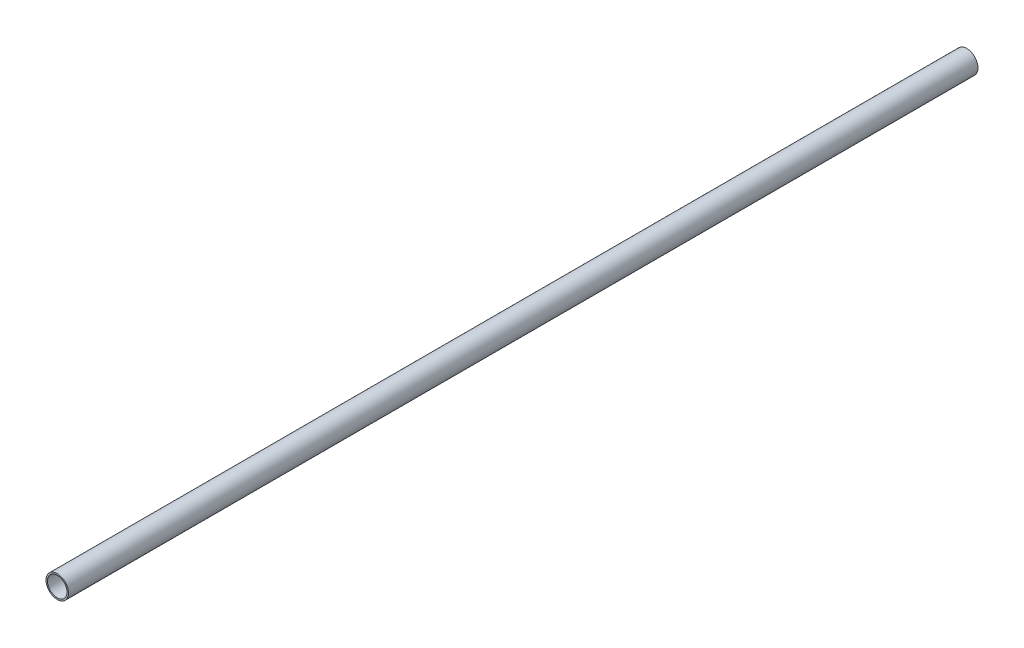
from build123d import *

# Parameters (mm, degrees)
SKETCH1_R      = 30.1625
SKETCH1_R_2    = 26.2509
EXTRUDE1_DEPTH = 2438.4


with BuildPart() as part:
    # Sketch1 → Extrude1 (new body)
    with BuildSketch(Plane.XY):
        with Locations(Location((0, 0, 0), (0, 0, 180))):
            Circle(SKETCH1_R)
        with Locations(Location((0, 0, 0), (0, 0, 180))):
            Circle(SKETCH1_R_2, mode=Mode.SUBTRACT)
    extrude(amount=EXTRUDE1_DEPTH)


solid = part.part
